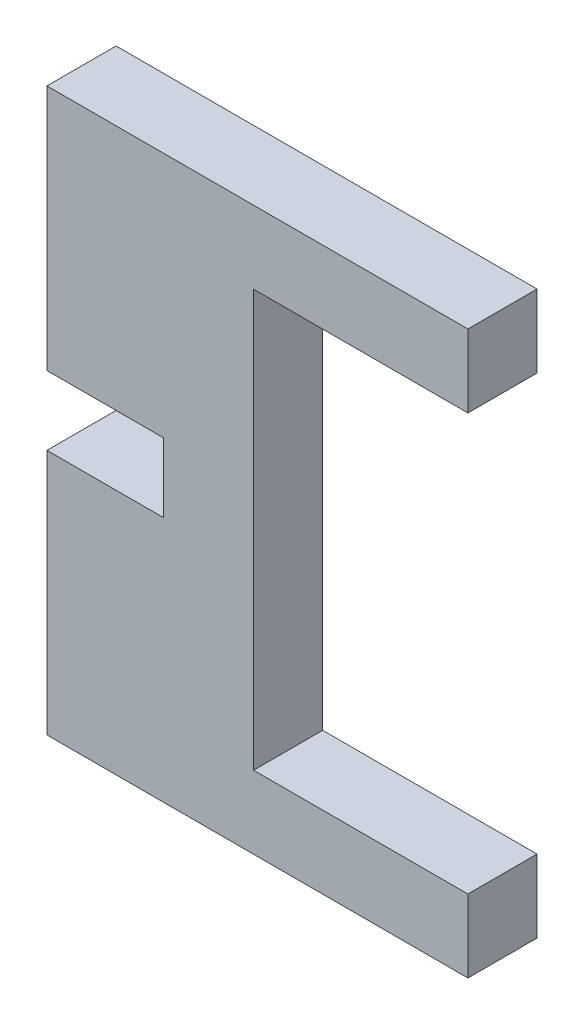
from build123d import *

# Parameters (mm, degrees)
EXTRUDE1_DEPTH = 5.842


with BuildPart() as part:
    # Sketch1 → Extrude1 (new body)
    with BuildSketch(Plane.XY):
        Polygon((0, 2.921), (0, -2.921), (-9.837625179, -2.921), (-9.837625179, -23.749418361), (25.736817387, -23.749418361), (25.736817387, -17.6022), (7.62, -17.6022), (7.62, 17.6022), (25.736817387, 17.6022), (25.736817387, 23.749418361), (-9.837625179, 23.749418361), (-9.837625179, 2.921), align=None)
    extrude(amount=EXTRUDE1_DEPTH)


solid = part.part
